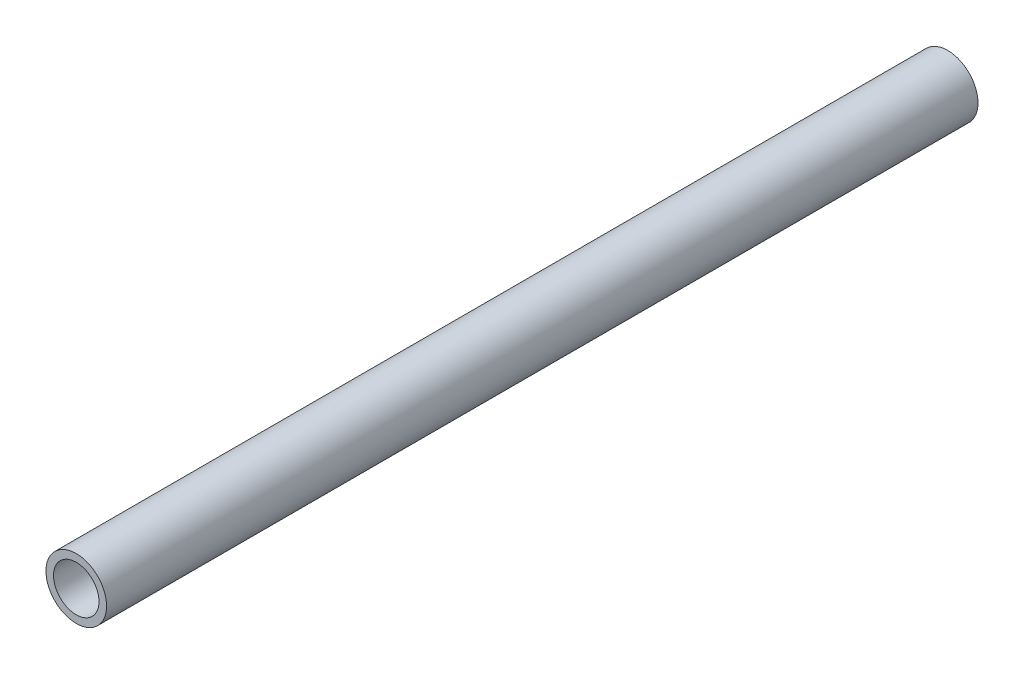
from build123d import *

# Parameters (mm, degrees)
SKETCH_1_R      = 4
SKETCH_1_R_2    = 3
EXTRUDE_1_DEPTH = 115


with BuildPart() as part:
    # Sketch 1 → Extrude 1 (new body)
    with BuildSketch(Plane.XY):
        Circle(SKETCH_1_R)
        Circle(SKETCH_1_R_2, mode=Mode.SUBTRACT)
    extrude(amount=EXTRUDE_1_DEPTH)


solid = part.part
